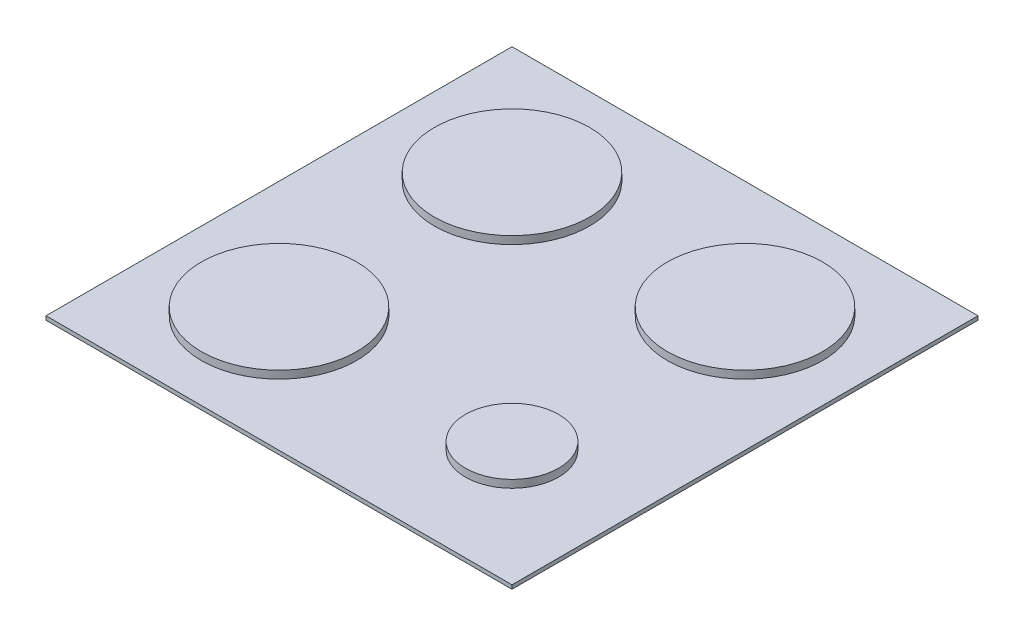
ISO-10303-21;
HEADER;
FILE_DESCRIPTION(('STEP AP214'),'2;1');
FILE_NAME('part.step','',(''),(''),'','','');
FILE_SCHEMA(('AUTOMOTIVE_DESIGN { 1 0 10303 214 1 1 1 1 }'));
ENDSEC;
DATA;
#1=APPLICATION_CONTEXT('core data for automotive mechanical design processes');
#2=APPLICATION_PROTOCOL_DEFINITION('international standard','automotive_design',2000,#1);
#3=PRODUCT_CONTEXT('',#1,'mechanical');
#4=PRODUCT('Part','Part','',(#3));
#5=PRODUCT_RELATED_PRODUCT_CATEGORY('part','',(#4));
#6=PRODUCT_DEFINITION_FORMATION('','',#4);
#7=PRODUCT_DEFINITION_CONTEXT('part definition',#1,'design');
#8=PRODUCT_DEFINITION('design','',#6,#7);
#9=PRODUCT_DEFINITION_SHAPE('','',#8);
#10=(LENGTH_UNIT() NAMED_UNIT(*) SI_UNIT(.MILLI.,.METRE.));
#11=(NAMED_UNIT(*) PLANE_ANGLE_UNIT() SI_UNIT($,.RADIAN.));
#12=(NAMED_UNIT(*) SI_UNIT($,.STERADIAN.) SOLID_ANGLE_UNIT());
#13=UNCERTAINTY_MEASURE_WITH_UNIT(LENGTH_MEASURE(1.E-05),#10,'distance_accuracy_value','');
#14=(GEOMETRIC_REPRESENTATION_CONTEXT(3) GLOBAL_UNCERTAINTY_ASSIGNED_CONTEXT((#13)) GLOBAL_UNIT_ASSIGNED_CONTEXT((#10,
#11,#12)) REPRESENTATION_CONTEXT('',''));
#15=CARTESIAN_POINT('',(0.,0.,0.));
#16=DIRECTION('',(0.,0.,1.));
#17=DIRECTION('',(1.,0.,0.));
#18=AXIS2_PLACEMENT_3D('',#15,#16,#17);
#19=CARTESIAN_POINT('',(0.,0.,600.));
#20=DIRECTION('',(1.,0.,0.));
#21=DIRECTION('',(0.,0.,-1.));
#22=AXIS2_PLACEMENT_3D('',#19,#20,#21);
#23=PLANE('',#22);
#24=DIRECTION('',(0.,-1.,0.));
#25=VECTOR('',#24,1.);
#26=CARTESIAN_POINT('',(0.,0.,0.));
#27=LINE('',#26,#25);
#28=CARTESIAN_POINT('',(0.,5.,0.));
#29=VERTEX_POINT('',#28);
#30=CARTESIAN_POINT('',(0.,0.,0.));
#31=VERTEX_POINT('',#30);
#32=EDGE_CURVE('E99',#29,#31,#27,.T.);
#33=ORIENTED_EDGE('',*,*,#32,.T.);
#34=DIRECTION('',(0.,0.,-1.));
#35=VECTOR('',#34,1.);
#36=CARTESIAN_POINT('',(0.,0.,600.));
#37=LINE('',#36,#35);
#38=CARTESIAN_POINT('',(0.,0.,600.));
#39=VERTEX_POINT('',#38);
#40=EDGE_CURVE('E90',#39,#31,#37,.T.);
#41=ORIENTED_EDGE('',*,*,#40,.F.);
#42=DIRECTION('',(0.,-1.,0.));
#43=VECTOR('',#42,1.);
#44=CARTESIAN_POINT('',(0.,0.,600.));
#45=LINE('',#44,#43);
#46=CARTESIAN_POINT('',(0.,5.,600.));
#47=VERTEX_POINT('',#46);
#48=EDGE_CURVE('E84',#47,#39,#45,.T.);
#49=ORIENTED_EDGE('',*,*,#48,.F.);
#50=DIRECTION('',(0.,0.,-1.));
#51=VECTOR('',#50,1.);
#52=CARTESIAN_POINT('',(0.,5.,600.));
#53=LINE('',#52,#51);
#54=EDGE_CURVE('E95',#47,#29,#53,.T.);
#55=ORIENTED_EDGE('',*,*,#54,.T.);
#56=EDGE_LOOP('',(#33,#41,#49,#55));
#57=FACE_BOUND('',#56,.T.);
#58=ADVANCED_FACE('F32',(#57),#23,.F.);
#59=CARTESIAN_POINT('',(0.,0.,600.));
#60=DIRECTION('',(0.,1.,0.));
#61=DIRECTION('',(0.,0.,1.));
#62=AXIS2_PLACEMENT_3D('',#59,#60,#61);
#63=PLANE('',#62);
#64=DIRECTION('',(1.,0.,0.));
#65=VECTOR('',#64,1.);
#66=CARTESIAN_POINT('',(0.,0.,0.));
#67=LINE('',#66,#65);
#68=CARTESIAN_POINT('',(600.,0.,0.));
#69=VERTEX_POINT('',#68);
#70=EDGE_CURVE('E89',#31,#69,#67,.T.);
#71=ORIENTED_EDGE('',*,*,#70,.T.);
#72=DIRECTION('',(0.,0.,-1.));
#73=VECTOR('',#72,1.);
#74=CARTESIAN_POINT('',(600.,0.,600.));
#75=LINE('',#74,#73);
#76=CARTESIAN_POINT('',(600.,0.,600.));
#77=VERTEX_POINT('',#76);
#78=EDGE_CURVE('E87',#77,#69,#75,.T.);
#79=ORIENTED_EDGE('',*,*,#78,.F.);
#80=DIRECTION('',(1.,0.,0.));
#81=VECTOR('',#80,1.);
#82=CARTESIAN_POINT('',(0.,0.,600.));
#83=LINE('',#82,#81);
#84=EDGE_CURVE('E79',#39,#77,#83,.T.);
#85=ORIENTED_EDGE('',*,*,#84,.F.);
#86=ORIENTED_EDGE('',*,*,#40,.T.);
#87=EDGE_LOOP('',(#71,#79,#85,#86));
#88=FACE_BOUND('',#87,.T.);
#89=ADVANCED_FACE('F88',(#88),#63,.F.);
#90=CARTESIAN_POINT('',(600.,0.,600.));
#91=DIRECTION('',(-1.,0.,0.));
#92=DIRECTION('',(0.,0.,1.));
#93=AXIS2_PLACEMENT_3D('',#90,#91,#92);
#94=PLANE('',#93);
#95=DIRECTION('',(0.,1.,0.));
#96=VECTOR('',#95,1.);
#97=CARTESIAN_POINT('',(600.,0.,0.));
#98=LINE('',#97,#96);
#99=CARTESIAN_POINT('',(600.,5.,0.));
#100=VERTEX_POINT('',#99);
#101=EDGE_CURVE('E65',#69,#100,#98,.T.);
#102=ORIENTED_EDGE('',*,*,#101,.T.);
#103=DIRECTION('',(0.,0.,-1.));
#104=VECTOR('',#103,1.);
#105=CARTESIAN_POINT('',(600.,5.,600.));
#106=LINE('',#105,#104);
#107=CARTESIAN_POINT('',(600.,5.,600.));
#108=VERTEX_POINT('',#107);
#109=EDGE_CURVE('E91',#108,#100,#106,.T.);
#110=ORIENTED_EDGE('',*,*,#109,.F.);
#111=DIRECTION('',(0.,1.,0.));
#112=VECTOR('',#111,1.);
#113=CARTESIAN_POINT('',(600.,0.,600.));
#114=LINE('',#113,#112);
#115=EDGE_CURVE('E82',#77,#108,#114,.T.);
#116=ORIENTED_EDGE('',*,*,#115,.F.);
#117=ORIENTED_EDGE('',*,*,#78,.T.);
#118=EDGE_LOOP('',(#102,#110,#116,#117));
#119=FACE_BOUND('',#118,.T.);
#120=ADVANCED_FACE('F93',(#119),#94,.F.);
#121=CARTESIAN_POINT('',(0.,5.,600.));
#122=DIRECTION('',(0.,-1.,0.));
#123=DIRECTION('',(0.,0.,-1.));
#124=AXIS2_PLACEMENT_3D('',#121,#122,#123);
#125=PLANE('',#124);
#126=CARTESIAN_POINT('',(450.,5.,450.));
#127=DIRECTION('',(0.,-1.,0.));
#128=DIRECTION('',(0.,0.,-1.));
#129=AXIS2_PLACEMENT_3D('',#126,#127,#128);
#130=CIRCLE('',#129,60.);
#131=CARTESIAN_POINT('',(450.,5.,390.));
#132=VERTEX_POINT('',#131);
#133=EDGE_CURVE('E11',#132,#132,#130,.F.);
#134=ORIENTED_EDGE('',*,*,#133,.F.);
#135=EDGE_LOOP('',(#134));
#136=FACE_BOUND('',#135,.T.);
#137=CARTESIAN_POINT('',(150.,5.,450.));
#138=DIRECTION('',(0.,-1.,0.));
#139=DIRECTION('',(0.,0.,-1.));
#140=AXIS2_PLACEMENT_3D('',#137,#138,#139);
#141=CIRCLE('',#140,100.);
#142=CARTESIAN_POINT('',(150.,5.,350.));
#143=VERTEX_POINT('',#142);
#144=EDGE_CURVE('E40',#143,#143,#141,.F.);
#145=ORIENTED_EDGE('',*,*,#144,.F.);
#146=EDGE_LOOP('',(#145));
#147=FACE_BOUND('',#146,.T.);
#148=CARTESIAN_POINT('',(450.,5.,150.));
#149=DIRECTION('',(0.,-1.,0.));
#150=DIRECTION('',(0.,0.,-1.));
#151=AXIS2_PLACEMENT_3D('',#148,#149,#150);
#152=CIRCLE('',#151,100.);
#153=CARTESIAN_POINT('',(450.,5.,50.));
#154=VERTEX_POINT('',#153);
#155=EDGE_CURVE('E112',#154,#154,#152,.F.);
#156=ORIENTED_EDGE('',*,*,#155,.F.);
#157=EDGE_LOOP('',(#156));
#158=FACE_BOUND('',#157,.T.);
#159=CARTESIAN_POINT('',(150.,5.,150.));
#160=DIRECTION('',(0.,-1.,0.));
#161=DIRECTION('',(0.,0.,-1.));
#162=AXIS2_PLACEMENT_3D('',#159,#160,#161);
#163=CIRCLE('',#162,100.);
#164=CARTESIAN_POINT('',(150.,5.,50.));
#165=VERTEX_POINT('',#164);
#166=EDGE_CURVE('E109',#165,#165,#163,.F.);
#167=ORIENTED_EDGE('',*,*,#166,.F.);
#168=EDGE_LOOP('',(#167));
#169=FACE_BOUND('',#168,.T.);
#170=DIRECTION('',(-1.,0.,0.));
#171=VECTOR('',#170,1.);
#172=CARTESIAN_POINT('',(0.,5.,0.));
#173=LINE('',#172,#171);
#174=EDGE_CURVE('E71',#100,#29,#173,.T.);
#175=ORIENTED_EDGE('',*,*,#174,.T.);
#176=ORIENTED_EDGE('',*,*,#54,.F.);
#177=DIRECTION('',(-1.,0.,0.));
#178=VECTOR('',#177,1.);
#179=CARTESIAN_POINT('',(0.,5.,600.));
#180=LINE('',#179,#178);
#181=EDGE_CURVE('E48',#108,#47,#180,.T.);
#182=ORIENTED_EDGE('',*,*,#181,.F.);
#183=ORIENTED_EDGE('',*,*,#109,.T.);
#184=EDGE_LOOP('',(#175,#176,#182,#183));
#185=FACE_BOUND('',#184,.T.);
#186=ADVANCED_FACE('F119',(#136,#147,#158,#169,#185),#125,.F.);
#187=CARTESIAN_POINT('',(0.,0.,600.));
#188=DIRECTION('',(0.,0.,-1.));
#189=DIRECTION('',(-1.,0.,0.));
#190=AXIS2_PLACEMENT_3D('',#187,#188,#189);
#191=PLANE('',#190);
#192=ORIENTED_EDGE('',*,*,#48,.T.);
#193=ORIENTED_EDGE('',*,*,#84,.T.);
#194=ORIENTED_EDGE('',*,*,#115,.T.);
#195=ORIENTED_EDGE('',*,*,#181,.T.);
#196=EDGE_LOOP('',(#192,#193,#194,#195));
#197=FACE_BOUND('',#196,.T.);
#198=ADVANCED_FACE('F80',(#197),#191,.F.);
#199=CARTESIAN_POINT('',(0.,0.,0.));
#200=DIRECTION('',(0.,0.,-1.));
#201=DIRECTION('',(-1.,0.,0.));
#202=AXIS2_PLACEMENT_3D('',#199,#200,#201);
#203=PLANE('',#202);
#204=ORIENTED_EDGE('',*,*,#32,.F.);
#205=ORIENTED_EDGE('',*,*,#174,.F.);
#206=ORIENTED_EDGE('',*,*,#101,.F.);
#207=ORIENTED_EDGE('',*,*,#70,.F.);
#208=EDGE_LOOP('',(#204,#205,#206,#207));
#209=FACE_BOUND('',#208,.T.);
#210=ADVANCED_FACE('F131',(#209),#203,.T.);
#211=CARTESIAN_POINT('',(150.,15.,150.));
#212=DIRECTION('',(0.,-1.,0.));
#213=DIRECTION('',(0.,0.,-1.));
#214=AXIS2_PLACEMENT_3D('',#211,#212,#213);
#215=CYLINDRICAL_SURFACE('',#214,100.);
#216=CARTESIAN_POINT('',(150.,15.,150.));
#217=DIRECTION('',(0.,1.,0.));
#218=DIRECTION('',(0.,0.,1.));
#219=AXIS2_PLACEMENT_3D('',#216,#217,#218);
#220=CIRCLE('',#219,100.);
#221=CARTESIAN_POINT('',(150.,15.,250.));
#222=VERTEX_POINT('',#221);
#223=EDGE_CURVE('E102',#222,#222,#220,.T.);
#224=ORIENTED_EDGE('',*,*,#223,.F.);
#225=EDGE_LOOP('',(#224));
#226=FACE_BOUND('',#225,.T.);
#227=ORIENTED_EDGE('',*,*,#166,.T.);
#228=EDGE_LOOP('',(#227));
#229=FACE_BOUND('',#228,.T.);
#230=ADVANCED_FACE('F128',(#226,#229),#215,.T.);
#231=CARTESIAN_POINT('',(150.,15.,150.));
#232=DIRECTION('',(0.,1.,0.));
#233=DIRECTION('',(0.,0.,1.));
#234=AXIS2_PLACEMENT_3D('',#231,#232,#233);
#235=PLANE('',#234);
#236=ORIENTED_EDGE('',*,*,#223,.T.);
#237=EDGE_LOOP('',(#236));
#238=FACE_BOUND('',#237,.T.);
#239=ADVANCED_FACE('F130',(#238),#235,.T.);
#240=CARTESIAN_POINT('',(450.,15.,150.));
#241=DIRECTION('',(0.,-1.,0.));
#242=DIRECTION('',(0.,0.,-1.));
#243=AXIS2_PLACEMENT_3D('',#240,#241,#242);
#244=CYLINDRICAL_SURFACE('',#243,100.);
#245=CARTESIAN_POINT('',(450.,15.,150.));
#246=DIRECTION('',(0.,1.,0.));
#247=DIRECTION('',(0.,0.,1.));
#248=AXIS2_PLACEMENT_3D('',#245,#246,#247);
#249=CIRCLE('',#248,100.);
#250=CARTESIAN_POINT('',(450.,15.,250.));
#251=VERTEX_POINT('',#250);
#252=EDGE_CURVE('E154',#251,#251,#249,.T.);
#253=ORIENTED_EDGE('',*,*,#252,.F.);
#254=EDGE_LOOP('',(#253));
#255=FACE_BOUND('',#254,.T.);
#256=ORIENTED_EDGE('',*,*,#155,.T.);
#257=EDGE_LOOP('',(#256));
#258=FACE_BOUND('',#257,.T.);
#259=ADVANCED_FACE('F138',(#255,#258),#244,.T.);
#260=CARTESIAN_POINT('',(450.,15.,150.));
#261=DIRECTION('',(0.,1.,0.));
#262=DIRECTION('',(0.,0.,1.));
#263=AXIS2_PLACEMENT_3D('',#260,#261,#262);
#264=PLANE('',#263);
#265=ORIENTED_EDGE('',*,*,#252,.T.);
#266=EDGE_LOOP('',(#265));
#267=FACE_BOUND('',#266,.T.);
#268=ADVANCED_FACE('F182',(#267),#264,.T.);
#269=CARTESIAN_POINT('',(150.,15.,450.));
#270=DIRECTION('',(0.,-1.,0.));
#271=DIRECTION('',(0.,0.,-1.));
#272=AXIS2_PLACEMENT_3D('',#269,#270,#271);
#273=CYLINDRICAL_SURFACE('',#272,100.);
#274=CARTESIAN_POINT('',(150.,15.,450.));
#275=DIRECTION('',(0.,1.,0.));
#276=DIRECTION('',(0.,0.,1.));
#277=AXIS2_PLACEMENT_3D('',#274,#275,#276);
#278=CIRCLE('',#277,100.);
#279=CARTESIAN_POINT('',(150.,15.,550.));
#280=VERTEX_POINT('',#279);
#281=EDGE_CURVE('E157',#280,#280,#278,.T.);
#282=ORIENTED_EDGE('',*,*,#281,.F.);
#283=EDGE_LOOP('',(#282));
#284=FACE_BOUND('',#283,.T.);
#285=ORIENTED_EDGE('',*,*,#144,.T.);
#286=EDGE_LOOP('',(#285));
#287=FACE_BOUND('',#286,.T.);
#288=ADVANCED_FACE('F117',(#284,#287),#273,.T.);
#289=CARTESIAN_POINT('',(150.,15.,450.));
#290=DIRECTION('',(0.,1.,0.));
#291=DIRECTION('',(0.,0.,1.));
#292=AXIS2_PLACEMENT_3D('',#289,#290,#291);
#293=PLANE('',#292);
#294=ORIENTED_EDGE('',*,*,#281,.T.);
#295=EDGE_LOOP('',(#294));
#296=FACE_BOUND('',#295,.T.);
#297=ADVANCED_FACE('F169',(#296),#293,.T.);
#298=CARTESIAN_POINT('',(450.,15.,450.));
#299=DIRECTION('',(0.,-1.,0.));
#300=DIRECTION('',(0.,0.,-1.));
#301=AXIS2_PLACEMENT_3D('',#298,#299,#300);
#302=CYLINDRICAL_SURFACE('',#301,60.);
#303=CARTESIAN_POINT('',(450.,15.,450.));
#304=DIRECTION('',(0.,1.,0.));
#305=DIRECTION('',(0.,0.,1.));
#306=AXIS2_PLACEMENT_3D('',#303,#304,#305);
#307=CIRCLE('',#306,60.);
#308=CARTESIAN_POINT('',(450.,15.,510.));
#309=VERTEX_POINT('',#308);
#310=EDGE_CURVE('E160',#309,#309,#307,.T.);
#311=ORIENTED_EDGE('',*,*,#310,.F.);
#312=EDGE_LOOP('',(#311));
#313=FACE_BOUND('',#312,.T.);
#314=ORIENTED_EDGE('',*,*,#133,.T.);
#315=EDGE_LOOP('',(#314));
#316=FACE_BOUND('',#315,.T.);
#317=ADVANCED_FACE('F166',(#313,#316),#302,.T.);
#318=CARTESIAN_POINT('',(450.,15.,450.));
#319=DIRECTION('',(0.,1.,0.));
#320=DIRECTION('',(0.,0.,1.));
#321=AXIS2_PLACEMENT_3D('',#318,#319,#320);
#322=PLANE('',#321);
#323=ORIENTED_EDGE('',*,*,#310,.T.);
#324=EDGE_LOOP('',(#323));
#325=FACE_BOUND('',#324,.T.);
#326=ADVANCED_FACE('F164',(#325),#322,.T.);
#327=CLOSED_SHELL('',(#58,#89,#120,#186,#198,#210,#230,#239,#259,#268,#288,#297,#317,#326));
#328=MANIFOLD_SOLID_BREP('B2',#327);
#329=ADVANCED_BREP_SHAPE_REPRESENTATION('',(#18,#328),#14);
#330=SHAPE_DEFINITION_REPRESENTATION(#9,#329);
ENDSEC;
END-ISO-10303-21;
